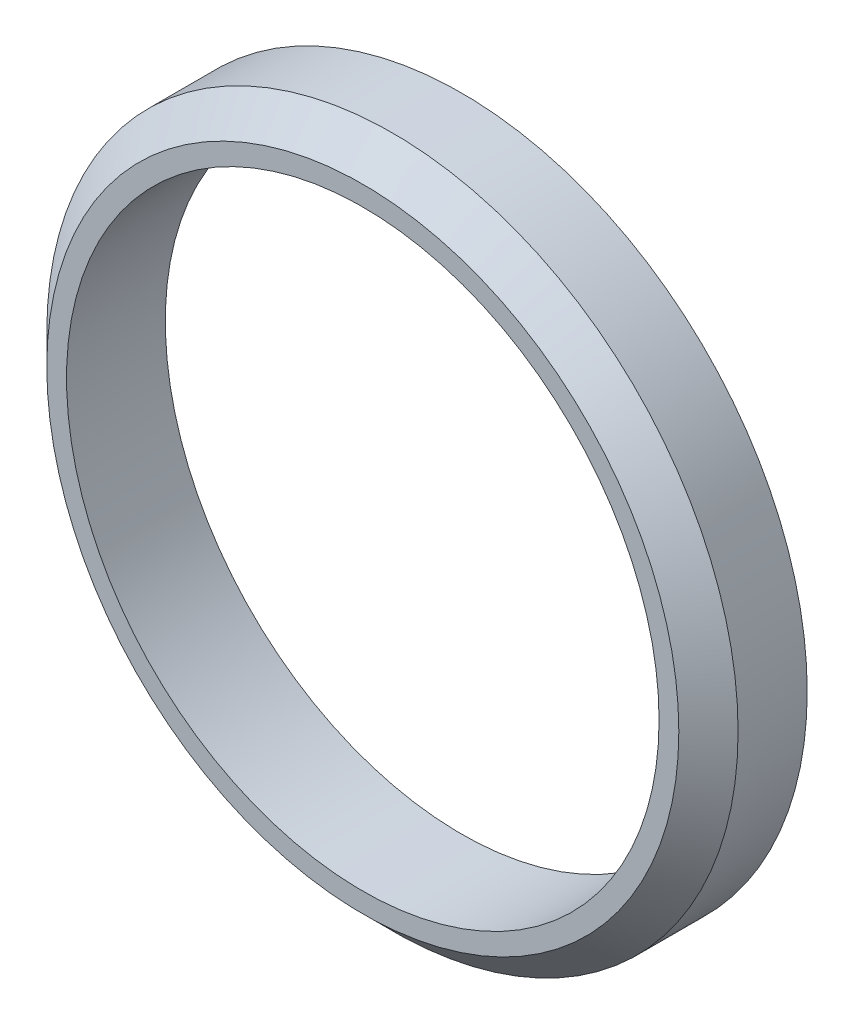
ISO-10303-21;
HEADER;
FILE_DESCRIPTION(('STEP AP214'),'2;1');
FILE_NAME('part.step','',(''),(''),'','','');
FILE_SCHEMA(('AUTOMOTIVE_DESIGN { 1 0 10303 214 1 1 1 1 }'));
ENDSEC;
DATA;
#1=APPLICATION_CONTEXT('core data for automotive mechanical design processes');
#2=APPLICATION_PROTOCOL_DEFINITION('international standard','automotive_design',2000,#1);
#3=PRODUCT_CONTEXT('',#1,'mechanical');
#4=PRODUCT('Part','Part','',(#3));
#5=PRODUCT_RELATED_PRODUCT_CATEGORY('part','',(#4));
#6=PRODUCT_DEFINITION_FORMATION('','',#4);
#7=PRODUCT_DEFINITION_CONTEXT('part definition',#1,'design');
#8=PRODUCT_DEFINITION('design','',#6,#7);
#9=PRODUCT_DEFINITION_SHAPE('','',#8);
#10=(LENGTH_UNIT() NAMED_UNIT(*) SI_UNIT(.MILLI.,.METRE.));
#11=(NAMED_UNIT(*) PLANE_ANGLE_UNIT() SI_UNIT($,.RADIAN.));
#12=(NAMED_UNIT(*) SI_UNIT($,.STERADIAN.) SOLID_ANGLE_UNIT());
#13=UNCERTAINTY_MEASURE_WITH_UNIT(LENGTH_MEASURE(1.E-05),#10,'distance_accuracy_value','');
#14=(GEOMETRIC_REPRESENTATION_CONTEXT(3) GLOBAL_UNCERTAINTY_ASSIGNED_CONTEXT((#13)) GLOBAL_UNIT_ASSIGNED_CONTEXT((#10,
#11,#12)) REPRESENTATION_CONTEXT('',''));
#15=CARTESIAN_POINT('',(0.,0.,0.));
#16=DIRECTION('',(0.,0.,1.));
#17=DIRECTION('',(1.,0.,0.));
#18=AXIS2_PLACEMENT_3D('',#15,#16,#17);
#19=CARTESIAN_POINT('',(0.,0.,10.));
#20=DIRECTION('',(0.,0.,1.));
#21=DIRECTION('',(1.,0.,0.));
#22=AXIS2_PLACEMENT_3D('',#19,#20,#21);
#23=PLANE('',#22);
#24=CARTESIAN_POINT('',(0.,0.,10.));
#25=DIRECTION('',(0.,0.,1.));
#26=DIRECTION('',(1.,0.,0.));
#27=AXIS2_PLACEMENT_3D('',#24,#25,#26);
#28=CIRCLE('',#27,32.);
#29=CARTESIAN_POINT('',(32.,0.,10.));
#30=VERTEX_POINT('',#29);
#31=EDGE_CURVE('E38',#30,#30,#28,.T.);
#32=ORIENTED_EDGE('',*,*,#31,.T.);
#33=EDGE_LOOP('',(#32));
#34=FACE_BOUND('',#33,.T.);
#35=CARTESIAN_POINT('',(0.,0.,10.));
#36=DIRECTION('',(0.,0.,1.));
#37=DIRECTION('',(1.,0.,0.));
#38=AXIS2_PLACEMENT_3D('',#35,#36,#37);
#39=CIRCLE('',#38,30.);
#40=CARTESIAN_POINT('',(30.,0.,10.));
#41=VERTEX_POINT('',#40);
#42=EDGE_CURVE('E46',#41,#41,#39,.T.);
#43=ORIENTED_EDGE('',*,*,#42,.F.);
#44=EDGE_LOOP('',(#43));
#45=FACE_BOUND('',#44,.T.);
#46=ADVANCED_FACE('F31',(#34,#45),#23,.T.);
#47=CARTESIAN_POINT('',(0.,0.,0.));
#48=DIRECTION('',(0.,0.,1.));
#49=DIRECTION('',(1.,0.,0.));
#50=AXIS2_PLACEMENT_3D('',#47,#48,#49);
#51=PLANE('',#50);
#52=CARTESIAN_POINT('',(0.,0.,0.));
#53=DIRECTION('',(0.,0.,1.));
#54=DIRECTION('',(1.,0.,0.));
#55=AXIS2_PLACEMENT_3D('',#52,#53,#54);
#56=CIRCLE('',#55,35.);
#57=CARTESIAN_POINT('',(35.,0.,0.));
#58=VERTEX_POINT('',#57);
#59=EDGE_CURVE('E42',#58,#58,#56,.T.);
#60=ORIENTED_EDGE('',*,*,#59,.F.);
#61=EDGE_LOOP('',(#60));
#62=FACE_BOUND('',#61,.T.);
#63=CARTESIAN_POINT('',(0.,0.,0.));
#64=DIRECTION('',(0.,0.,1.));
#65=DIRECTION('',(1.,0.,0.));
#66=AXIS2_PLACEMENT_3D('',#63,#64,#65);
#67=CIRCLE('',#66,30.);
#68=CARTESIAN_POINT('',(30.,0.,0.));
#69=VERTEX_POINT('',#68);
#70=EDGE_CURVE('E49',#69,#69,#67,.T.);
#71=ORIENTED_EDGE('',*,*,#70,.T.);
#72=EDGE_LOOP('',(#71));
#73=FACE_BOUND('',#72,.T.);
#74=ADVANCED_FACE('F59',(#62,#73),#51,.F.);
#75=CARTESIAN_POINT('',(0.,0.,10.));
#76=DIRECTION('',(0.,0.,-1.));
#77=DIRECTION('',(-1.,0.,0.));
#78=AXIS2_PLACEMENT_3D('',#75,#76,#77);
#79=CYLINDRICAL_SURFACE('',#78,35.);
#80=CARTESIAN_POINT('',(0.,0.,7.));
#81=DIRECTION('',(0.,0.,1.));
#82=DIRECTION('',(1.,0.,0.));
#83=AXIS2_PLACEMENT_3D('',#80,#81,#82);
#84=CIRCLE('',#83,35.);
#85=CARTESIAN_POINT('',(35.,0.,7.));
#86=VERTEX_POINT('',#85);
#87=EDGE_CURVE('E10',#86,#86,#84,.F.);
#88=ORIENTED_EDGE('',*,*,#87,.T.);
#89=EDGE_LOOP('',(#88));
#90=FACE_BOUND('',#89,.T.);
#91=ORIENTED_EDGE('',*,*,#59,.T.);
#92=EDGE_LOOP('',(#91));
#93=FACE_BOUND('',#92,.T.);
#94=ADVANCED_FACE('F64',(#90,#93),#79,.T.);
#95=CARTESIAN_POINT('',(0.,0.,10.));
#96=DIRECTION('',(0.,0.,-1.));
#97=DIRECTION('',(-1.,0.,0.));
#98=AXIS2_PLACEMENT_3D('',#95,#96,#97);
#99=CYLINDRICAL_SURFACE('',#98,30.);
#100=ORIENTED_EDGE('',*,*,#42,.T.);
#101=EDGE_LOOP('',(#100));
#102=FACE_BOUND('',#101,.T.);
#103=ORIENTED_EDGE('',*,*,#70,.F.);
#104=EDGE_LOOP('',(#103));
#105=FACE_BOUND('',#104,.T.);
#106=ADVANCED_FACE('F55',(#102,#105),#99,.F.);
#107=CARTESIAN_POINT('',(0.,0.,10.));
#108=DIRECTION('',(0.,0.,-1.));
#109=DIRECTION('',(-1.,0.,0.));
#110=AXIS2_PLACEMENT_3D('',#107,#108,#109);
#111=CONICAL_SURFACE('',#110,32.,0.785398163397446);
#112=ORIENTED_EDGE('',*,*,#87,.F.);
#113=EDGE_LOOP('',(#112));
#114=FACE_BOUND('',#113,.T.);
#115=ORIENTED_EDGE('',*,*,#31,.F.);
#116=EDGE_LOOP('',(#115));
#117=FACE_BOUND('',#116,.T.);
#118=ADVANCED_FACE('F33',(#114,#117),#111,.T.);
#119=CLOSED_SHELL('',(#46,#74,#94,#106,#118));
#120=MANIFOLD_SOLID_BREP('B2',#119);
#121=ADVANCED_BREP_SHAPE_REPRESENTATION('',(#18,#120),#14);
#122=SHAPE_DEFINITION_REPRESENTATION(#9,#121);
ENDSEC;
END-ISO-10303-21;
